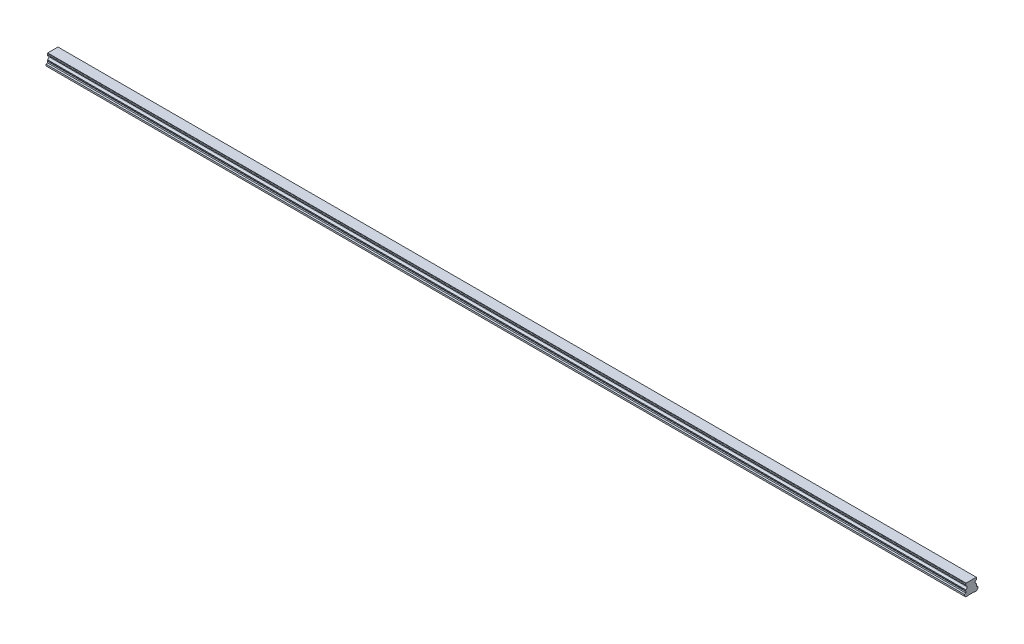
from build123d import *

# Parameters (mm, degrees)
BOSS_EXTRUDE1_DEPTH        = 1680
SKETCH3_R                  = 3
SKETCH3_R_2                = 2.5
CUT_EXTRUDE3_DEPTH         = 12
SKETCH3_2_R                = 2.5
CUT_EXTRUDE4_DEPTH         = 15
CHAMFER1_SIZE              = 0.5
LPATTERN4_COUNT            = 28
LPATTERN4_PITCH            = 60
CHAMFER1_OF_LPATTERN4_SIZE = 0.5


with BuildPart() as part:
    # Sketch1 → Boss-Extrude1 (new body)
    with BuildSketch(Plane(origin=(0, 0, 0), x_dir=(0, 0, -1), z_dir=(1, 0, 0))):
        with BuildLine():
            Line((9.375, 21.8), (-9.375, 21.8))
            Line((-9.375, 21.8), (-9.375, 20.756))
            Line((-9.375, 20.756), (-10, 19.415683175))
            Line((-10, 19.415683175), (-10, 17.685449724))
            ThreePointArc((-10, 17.685449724), (-7.2, 14.6), (-10, 11.514550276))
            Line((-10, 11.514550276), (-10, 9.784316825))
            Line((-10, 9.784316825), (-9.375, 8.444))
            Line((-9.375, 8.444), (-9.922688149, 6.4))
            Line((-9.922688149, 6.4), (-12.5, 5.489338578))
            Line((-12.5, 5.489338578), (-12.5, 2.65))
            Line((-12.5, 2.65), (-9.85, 0))
            Line((-9.85, 0), (-5.5, 0))
            Line((-5.5, 0), (-5, 0.5))
            Line((-5, 0.5), (5, 0.5))
            Line((5, 0.5), (5.5, 0))
            Line((5.5, 0), (9.85, 0))
            Line((9.85, 0), (12.5, 2.65))
            Line((12.5, 2.65), (12.5, 5.489338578))
            Line((12.5, 5.489338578), (9.922688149, 6.4))
            Line((9.922688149, 6.4), (9.375, 8.444))
            Line((9.375, 8.444), (10, 9.784316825))
            Line((10, 9.784316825), (10, 11.514550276))
            ThreePointArc((10, 11.514550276), (7.2, 14.6), (10, 17.685449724))
            Line((10, 17.685449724), (10, 19.415683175))
            Line((10, 19.415683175), (9.375, 20.756))
            Line((9.375, 20.756), (9.375, 21.8))
        make_face()
    extrude(amount=BOSS_EXTRUDE1_DEPTH)

    # Sketch3 → Cut-Extrude3 (cut)
    with BuildSketch(Plane.XZ):
        with Locations(Location((30, 0, 0), (0, 0, 270))):
            Circle(SKETCH3_R)
        with Locations(Location((30, 0, 0), (0, 0, 270))):
            Circle(SKETCH3_R_2, mode=Mode.SUBTRACT)
    cut_extrude3 = extrude(amount=-CUT_EXTRUDE3_DEPTH, mode=Mode.SUBTRACT)

    # Sketch3_2 → Cut-Extrude4 (cut)
    with BuildSketch(Plane.XZ):
        with Locations(Location((30, 0, 0), (0, 0, 270))):
            Circle(SKETCH3_2_R)
    cut_extrude4 = extrude(amount=-CUT_EXTRUDE4_DEPTH, mode=Mode.SUBTRACT)

    # Cut-Extrude5 cone 1 section (on through the dimple's axis) → Cut-Extrude5 (revolve, cut)
    with BuildSketch(Plane(origin=(30, 15, 0), x_dir=(0, 0, -1), z_dir=(1, 0, 0))):
        Polygon((0, 0), (2.5, 0), (0, 1.443375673), align=None)
    cut_extrude5 = revolve(axis=Axis((30, 15, 0), (0, 1, 0)), mode=Mode.SUBTRACT)

    # Chamfer1
    chamfer1_edges = [part.edges().sort_by_distance(p)[0] for p in [
        (30, 0.5, 3),
    ]]
    chamfer(chamfer1_edges, length=CHAMFER1_SIZE)

    # LPattern4: Cut-Extrude3, Cut-Extrude4, Cut-Extrude5 ×28
    with Locations(*[(i * LPATTERN4_PITCH, 0, 0) for i in range(1, LPATTERN4_COUNT)]):
        add(cut_extrude3, mode=Mode.SUBTRACT)
        add(cut_extrude4, mode=Mode.SUBTRACT)
        add(cut_extrude5, mode=Mode.SUBTRACT)

    # Chamfer1 of LPattern4
    chamfer1_of_lpattern4_edges = [part.edges().sort_by_distance(p)[0] for p in [
        (90, 0.5, 3),
        (150, 0.5, 3),
        (210, 0.5, 3),
        (270, 0.5, 3),
        (330, 0.5, 3),
        (390, 0.5, 3),
        (450, 0.5, 3),
        (510, 0.5, 3),
        (570, 0.5, 3),
        (630, 0.5, 3),
        (690, 0.5, 3),
        (750, 0.5, 3),
        (810, 0.5, 3),
        (870, 0.5, 3),
        (930, 0.5, 3),
        (990, 0.5, 3),
        (1050, 0.5, 3),
        (1110, 0.5, 3),
        (1170, 0.5, 3),
        (1230, 0.5, 3),
        (1290, 0.5, 3),
        (1350, 0.5, 3),
        (1410, 0.5, 3),
        (1470, 0.5, 3),
        (1530, 0.5, 3),
        (1590, 0.5, 3),
        (1650, 0.5, 3),
    ]]
    chamfer(chamfer1_of_lpattern4_edges, length=CHAMFER1_OF_LPATTERN4_SIZE)


solid = part.part
